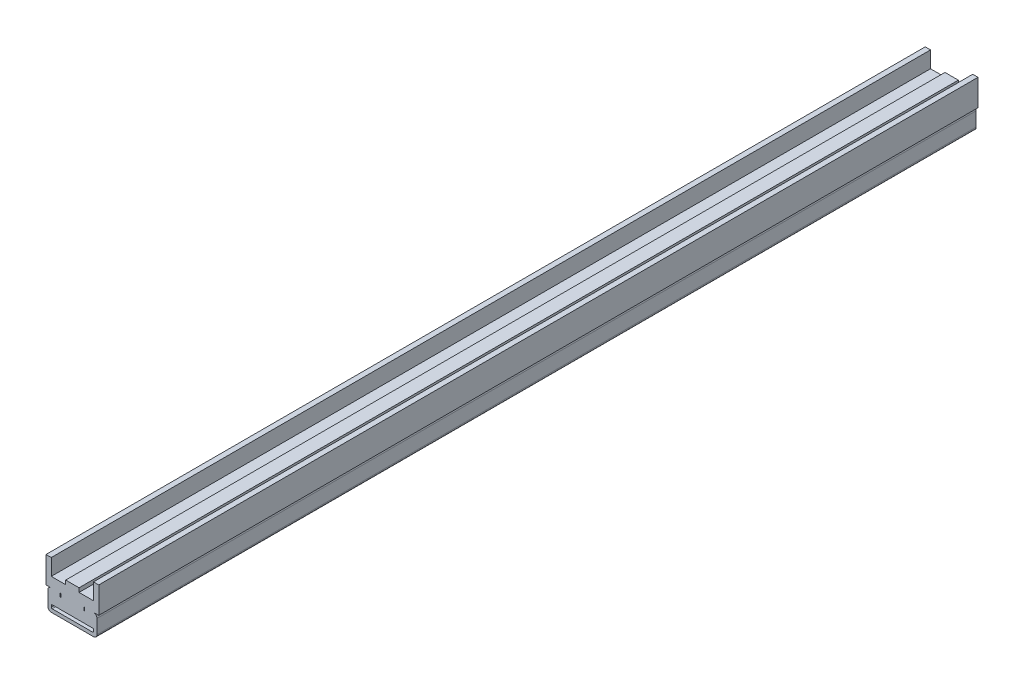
ISO-10303-21;
HEADER;
FILE_DESCRIPTION(('STEP AP214'),'2;1');
FILE_NAME('part.step','',(''),(''),'','','');
FILE_SCHEMA(('AUTOMOTIVE_DESIGN { 1 0 10303 214 1 1 1 1 }'));
ENDSEC;
DATA;
#1=APPLICATION_CONTEXT('core data for automotive mechanical design processes');
#2=APPLICATION_PROTOCOL_DEFINITION('international standard','automotive_design',2000,#1);
#3=PRODUCT_CONTEXT('',#1,'mechanical');
#4=PRODUCT('Part','Part','',(#3));
#5=PRODUCT_RELATED_PRODUCT_CATEGORY('part','',(#4));
#6=PRODUCT_DEFINITION_FORMATION('','',#4);
#7=PRODUCT_DEFINITION_CONTEXT('part definition',#1,'design');
#8=PRODUCT_DEFINITION('design','',#6,#7);
#9=PRODUCT_DEFINITION_SHAPE('','',#8);
#10=(LENGTH_UNIT() NAMED_UNIT(*) SI_UNIT(.MILLI.,.METRE.));
#11=(NAMED_UNIT(*) PLANE_ANGLE_UNIT() SI_UNIT($,.RADIAN.));
#12=(NAMED_UNIT(*) SI_UNIT($,.STERADIAN.) SOLID_ANGLE_UNIT());
#13=UNCERTAINTY_MEASURE_WITH_UNIT(LENGTH_MEASURE(1.E-05),#10,'distance_accuracy_value','');
#14=(GEOMETRIC_REPRESENTATION_CONTEXT(3) GLOBAL_UNCERTAINTY_ASSIGNED_CONTEXT((#13)) GLOBAL_UNIT_ASSIGNED_CONTEXT((#10,
#11,#12)) REPRESENTATION_CONTEXT('',''));
#15=CARTESIAN_POINT('',(0.,0.,0.));
#16=DIRECTION('',(0.,0.,1.));
#17=DIRECTION('',(1.,0.,0.));
#18=AXIS2_PLACEMENT_3D('',#15,#16,#17);
#19=CARTESIAN_POINT('',(-12.,10.,500.));
#20=DIRECTION('',(0.,0.,1.));
#21=DIRECTION('',(1.,0.,0.));
#22=AXIS2_PLACEMENT_3D('',#19,#20,#21);
#23=PLANE('',#22);
#24=DIRECTION('',(1.,0.,0.));
#25=VECTOR('',#24,1.);
#26=CARTESIAN_POINT('',(-7.,10.,500.));
#27=LINE('',#26,#25);
#28=CARTESIAN_POINT('',(-7.,10.,500.));
#29=VERTEX_POINT('',#28);
#30=CARTESIAN_POINT('',(-6.5,10.,500.));
#31=VERTEX_POINT('',#30);
#32=EDGE_CURVE('E273',#29,#31,#27,.T.);
#33=ORIENTED_EDGE('',*,*,#32,.F.);
#34=DIRECTION('',(0.,-1.,0.));
#35=VECTOR('',#34,1.);
#36=CARTESIAN_POINT('',(-7.,12.,500.));
#37=LINE('',#36,#35);
#38=CARTESIAN_POINT('',(-7.,12.,500.));
#39=VERTEX_POINT('',#38);
#40=EDGE_CURVE('E271',#39,#29,#37,.T.);
#41=ORIENTED_EDGE('',*,*,#40,.F.);
#42=DIRECTION('',(-1.,0.,0.));
#43=VECTOR('',#42,1.);
#44=CARTESIAN_POINT('',(-7.,12.,500.));
#45=LINE('',#44,#43);
#46=CARTESIAN_POINT('',(-6.5,12.,500.));
#47=VERTEX_POINT('',#46);
#48=EDGE_CURVE('E279',#47,#39,#45,.T.);
#49=ORIENTED_EDGE('',*,*,#48,.F.);
#50=DIRECTION('',(0.,1.,0.));
#51=VECTOR('',#50,1.);
#52=CARTESIAN_POINT('',(-6.5,12.,500.));
#53=LINE('',#52,#51);
#54=EDGE_CURVE('E276',#31,#47,#53,.T.);
#55=ORIENTED_EDGE('',*,*,#54,.F.);
#56=EDGE_LOOP('',(#33,#41,#49,#55));
#57=FACE_BOUND('',#56,.T.);
#58=CARTESIAN_POINT('',(-12.,10.,500.));
#59=DIRECTION('',(0.,0.,1.));
#60=DIRECTION('',(1.,0.,0.));
#61=AXIS2_PLACEMENT_3D('',#58,#59,#60);
#62=CIRCLE('',#61,2.);
#63=CARTESIAN_POINT('',(-12.,12.,500.));
#64=VERTEX_POINT('',#63);
#65=CARTESIAN_POINT('',(-14.,10.,500.));
#66=VERTEX_POINT('',#65);
#67=EDGE_CURVE('E347',#64,#66,#62,.T.);
#68=ORIENTED_EDGE('',*,*,#67,.T.);
#69=DIRECTION('',(0.,-1.,0.));
#70=VECTOR('',#69,1.);
#71=CARTESIAN_POINT('',(-14.,2.,500.));
#72=LINE('',#71,#70);
#73=CARTESIAN_POINT('',(-14.,2.,500.));
#74=VERTEX_POINT('',#73);
#75=EDGE_CURVE('E350',#66,#74,#72,.T.);
#76=ORIENTED_EDGE('',*,*,#75,.T.);
#77=CARTESIAN_POINT('',(-12.,2.,500.));
#78=DIRECTION('',(0.,0.,1.));
#79=DIRECTION('',(1.,0.,0.));
#80=AXIS2_PLACEMENT_3D('',#77,#78,#79);
#81=CIRCLE('',#80,2.);
#82=CARTESIAN_POINT('',(-12.,0.,500.));
#83=VERTEX_POINT('',#82);
#84=EDGE_CURVE('E353',#74,#83,#81,.T.);
#85=ORIENTED_EDGE('',*,*,#84,.T.);
#86=DIRECTION('',(1.,0.,0.));
#87=VECTOR('',#86,1.);
#88=CARTESIAN_POINT('',(-12.,0.,500.));
#89=LINE('',#88,#87);
#90=CARTESIAN_POINT('',(12.,0.,500.));
#91=VERTEX_POINT('',#90);
#92=EDGE_CURVE('E355',#83,#91,#89,.T.);
#93=ORIENTED_EDGE('',*,*,#92,.T.);
#94=CARTESIAN_POINT('',(12.,2.,500.));
#95=DIRECTION('',(0.,0.,1.));
#96=DIRECTION('',(1.,0.,0.));
#97=AXIS2_PLACEMENT_3D('',#94,#95,#96);
#98=CIRCLE('',#97,2.);
#99=CARTESIAN_POINT('',(14.,2.,500.));
#100=VERTEX_POINT('',#99);
#101=EDGE_CURVE('E357',#91,#100,#98,.T.);
#102=ORIENTED_EDGE('',*,*,#101,.T.);
#103=DIRECTION('',(0.,1.,0.));
#104=VECTOR('',#103,1.);
#105=CARTESIAN_POINT('',(14.,2.,500.));
#106=LINE('',#105,#104);
#107=CARTESIAN_POINT('',(14.,10.,500.));
#108=VERTEX_POINT('',#107);
#109=EDGE_CURVE('E359',#100,#108,#106,.T.);
#110=ORIENTED_EDGE('',*,*,#109,.T.);
#111=CARTESIAN_POINT('',(12.,10.,500.));
#112=DIRECTION('',(0.,0.,1.));
#113=DIRECTION('',(1.,0.,0.));
#114=AXIS2_PLACEMENT_3D('',#111,#112,#113);
#115=CIRCLE('',#114,2.);
#116=CARTESIAN_POINT('',(12.,12.,500.));
#117=VERTEX_POINT('',#116);
#118=EDGE_CURVE('E361',#108,#117,#115,.T.);
#119=ORIENTED_EDGE('',*,*,#118,.T.);
#120=DIRECTION('',(1.,0.,0.));
#121=VECTOR('',#120,1.);
#122=CARTESIAN_POINT('',(12.,12.,500.));
#123=LINE('',#122,#121);
#124=CARTESIAN_POINT('',(15.,12.,500.));
#125=VERTEX_POINT('',#124);
#126=EDGE_CURVE('E363',#117,#125,#123,.T.);
#127=ORIENTED_EDGE('',*,*,#126,.T.);
#128=DIRECTION('',(0.,1.,0.));
#129=VECTOR('',#128,1.);
#130=CARTESIAN_POINT('',(15.,12.,500.));
#131=LINE('',#130,#129);
#132=CARTESIAN_POINT('',(15.,27.,500.));
#133=VERTEX_POINT('',#132);
#134=EDGE_CURVE('E365',#125,#133,#131,.T.);
#135=ORIENTED_EDGE('',*,*,#134,.T.);
#136=DIRECTION('',(-1.,0.,0.));
#137=VECTOR('',#136,1.);
#138=CARTESIAN_POINT('',(15.,27.,500.));
#139=LINE('',#138,#137);
#140=CARTESIAN_POINT('',(12.,27.,500.));
#141=VERTEX_POINT('',#140);
#142=EDGE_CURVE('E367',#133,#141,#139,.T.);
#143=ORIENTED_EDGE('',*,*,#142,.T.);
#144=DIRECTION('',(0.,-1.,0.));
#145=VECTOR('',#144,1.);
#146=CARTESIAN_POINT('',(12.,27.,500.));
#147=LINE('',#146,#145);
#148=CARTESIAN_POINT('',(12.,17.7,500.));
#149=VERTEX_POINT('',#148);
#150=EDGE_CURVE('E369',#141,#149,#147,.T.);
#151=ORIENTED_EDGE('',*,*,#150,.T.);
#152=DIRECTION('',(-1.,0.,0.));
#153=VECTOR('',#152,1.);
#154=CARTESIAN_POINT('',(12.,17.7,500.));
#155=LINE('',#154,#153);
#156=CARTESIAN_POINT('',(3.8,17.7,500.));
#157=VERTEX_POINT('',#156);
#158=EDGE_CURVE('E371',#149,#157,#155,.T.);
#159=ORIENTED_EDGE('',*,*,#158,.T.);
#160=DIRECTION('',(0.,1.,0.));
#161=VECTOR('',#160,1.);
#162=CARTESIAN_POINT('',(3.8,17.7,500.));
#163=LINE('',#162,#161);
#164=CARTESIAN_POINT('',(3.8,20.,500.));
#165=VERTEX_POINT('',#164);
#166=EDGE_CURVE('E373',#157,#165,#163,.T.);
#167=ORIENTED_EDGE('',*,*,#166,.T.);
#168=DIRECTION('',(-1.,0.,0.));
#169=VECTOR('',#168,1.);
#170=CARTESIAN_POINT('',(3.8,20.,500.));
#171=LINE('',#170,#169);
#172=CARTESIAN_POINT('',(-3.8,20.,500.));
#173=VERTEX_POINT('',#172);
#174=EDGE_CURVE('E375',#165,#173,#171,.T.);
#175=ORIENTED_EDGE('',*,*,#174,.T.);
#176=DIRECTION('',(0.,-1.,0.));
#177=VECTOR('',#176,1.);
#178=CARTESIAN_POINT('',(-3.8,20.,500.));
#179=LINE('',#178,#177);
#180=CARTESIAN_POINT('',(-3.8,17.7,500.));
#181=VERTEX_POINT('',#180);
#182=EDGE_CURVE('E377',#173,#181,#179,.T.);
#183=ORIENTED_EDGE('',*,*,#182,.T.);
#184=DIRECTION('',(-1.,0.,0.));
#185=VECTOR('',#184,1.);
#186=CARTESIAN_POINT('',(-3.8,17.7,500.));
#187=LINE('',#186,#185);
#188=CARTESIAN_POINT('',(-12.,17.7,500.));
#189=VERTEX_POINT('',#188);
#190=EDGE_CURVE('E379',#181,#189,#187,.T.);
#191=ORIENTED_EDGE('',*,*,#190,.T.);
#192=DIRECTION('',(0.,1.,0.));
#193=VECTOR('',#192,1.);
#194=CARTESIAN_POINT('',(-12.,17.7,500.));
#195=LINE('',#194,#193);
#196=CARTESIAN_POINT('',(-12.,27.,500.));
#197=VERTEX_POINT('',#196);
#198=EDGE_CURVE('E381',#189,#197,#195,.T.);
#199=ORIENTED_EDGE('',*,*,#198,.T.);
#200=DIRECTION('',(-1.,0.,0.));
#201=VECTOR('',#200,1.);
#202=CARTESIAN_POINT('',(-12.,27.,500.));
#203=LINE('',#202,#201);
#204=CARTESIAN_POINT('',(-15.,27.,500.));
#205=VERTEX_POINT('',#204);
#206=EDGE_CURVE('E383',#197,#205,#203,.T.);
#207=ORIENTED_EDGE('',*,*,#206,.T.);
#208=DIRECTION('',(0.,-1.,0.));
#209=VECTOR('',#208,1.);
#210=CARTESIAN_POINT('',(-15.,27.,500.));
#211=LINE('',#210,#209);
#212=CARTESIAN_POINT('',(-15.,12.,500.));
#213=VERTEX_POINT('',#212);
#214=EDGE_CURVE('E385',#205,#213,#211,.T.);
#215=ORIENTED_EDGE('',*,*,#214,.T.);
#216=DIRECTION('',(1.,0.,0.));
#217=VECTOR('',#216,1.);
#218=CARTESIAN_POINT('',(-15.,12.,500.));
#219=LINE('',#218,#217);
#220=EDGE_CURVE('E387',#213,#64,#219,.T.);
#221=ORIENTED_EDGE('',*,*,#220,.T.);
#222=EDGE_LOOP('',(#68,#76,#85,#93,#102,#110,#119,#127,#135,#143,#151,#159,#167,#175,#183,#191,
#199,#207,#215,#221));
#223=FACE_BOUND('',#222,.T.);
#224=CARTESIAN_POINT('',(-11.5,2.5,500.));
#225=DIRECTION('',(0.,0.,1.));
#226=DIRECTION('',(1.,0.,0.));
#227=AXIS2_PLACEMENT_3D('',#224,#225,#226);
#228=CIRCLE('',#227,0.5);
#229=CARTESIAN_POINT('',(-12.,2.5,500.));
#230=VERTEX_POINT('',#229);
#231=CARTESIAN_POINT('',(-11.5,2.,500.));
#232=VERTEX_POINT('',#231);
#233=EDGE_CURVE('E304',#230,#232,#228,.T.);
#234=ORIENTED_EDGE('',*,*,#233,.F.);
#235=DIRECTION('',(0.,-1.,0.));
#236=VECTOR('',#235,1.);
#237=CARTESIAN_POINT('',(-12.,4.,500.));
#238=LINE('',#237,#236);
#239=CARTESIAN_POINT('',(-12.,4.,500.));
#240=VERTEX_POINT('',#239);
#241=EDGE_CURVE('E302',#240,#230,#238,.T.);
#242=ORIENTED_EDGE('',*,*,#241,.F.);
#243=DIRECTION('',(-1.,0.,0.));
#244=VECTOR('',#243,1.);
#245=CARTESIAN_POINT('',(-12.,4.,500.));
#246=LINE('',#245,#244);
#247=CARTESIAN_POINT('',(12.,4.,500.));
#248=VERTEX_POINT('',#247);
#249=EDGE_CURVE('E314',#248,#240,#246,.T.);
#250=ORIENTED_EDGE('',*,*,#249,.F.);
#251=DIRECTION('',(0.,1.,0.));
#252=VECTOR('',#251,1.);
#253=CARTESIAN_POINT('',(12.,4.,500.));
#254=LINE('',#253,#252);
#255=CARTESIAN_POINT('',(12.,2.5,500.));
#256=VERTEX_POINT('',#255);
#257=EDGE_CURVE('E311',#256,#248,#254,.T.);
#258=ORIENTED_EDGE('',*,*,#257,.F.);
#259=CARTESIAN_POINT('',(11.5,2.5,500.));
#260=DIRECTION('',(0.,0.,1.));
#261=DIRECTION('',(-1.,0.,0.));
#262=AXIS2_PLACEMENT_3D('',#259,#260,#261);
#263=CIRCLE('',#262,0.5);
#264=CARTESIAN_POINT('',(11.5,2.,500.));
#265=VERTEX_POINT('',#264);
#266=EDGE_CURVE('E309',#265,#256,#263,.T.);
#267=ORIENTED_EDGE('',*,*,#266,.F.);
#268=DIRECTION('',(1.,0.,0.));
#269=VECTOR('',#268,1.);
#270=CARTESIAN_POINT('',(-11.5,2.,500.));
#271=LINE('',#270,#269);
#272=EDGE_CURVE('E307',#232,#265,#271,.T.);
#273=ORIENTED_EDGE('',*,*,#272,.F.);
#274=EDGE_LOOP('',(#234,#242,#250,#258,#267,#273));
#275=FACE_BOUND('',#274,.T.);
#276=DIRECTION('',(-1.,0.,0.));
#277=VECTOR('',#276,1.);
#278=CARTESIAN_POINT('',(7.,12.,500.));
#279=LINE('',#278,#277);
#280=CARTESIAN_POINT('',(7.,12.,500.));
#281=VERTEX_POINT('',#280);
#282=CARTESIAN_POINT('',(6.5,12.,500.));
#283=VERTEX_POINT('',#282);
#284=EDGE_CURVE('E243',#281,#283,#279,.T.);
#285=ORIENTED_EDGE('',*,*,#284,.F.);
#286=DIRECTION('',(0.,1.,0.));
#287=VECTOR('',#286,1.);
#288=CARTESIAN_POINT('',(7.,12.,500.));
#289=LINE('',#288,#287);
#290=CARTESIAN_POINT('',(7.,10.,500.));
#291=VERTEX_POINT('',#290);
#292=EDGE_CURVE('E235',#291,#281,#289,.T.);
#293=ORIENTED_EDGE('',*,*,#292,.F.);
#294=DIRECTION('',(1.,0.,0.));
#295=VECTOR('',#294,1.);
#296=CARTESIAN_POINT('',(7.,10.,500.));
#297=LINE('',#296,#295);
#298=CARTESIAN_POINT('',(6.5,10.,500.));
#299=VERTEX_POINT('',#298);
#300=EDGE_CURVE('E257',#299,#291,#297,.T.);
#301=ORIENTED_EDGE('',*,*,#300,.F.);
#302=DIRECTION('',(0.,-1.,0.));
#303=VECTOR('',#302,1.);
#304=CARTESIAN_POINT('',(6.5,12.,500.));
#305=LINE('',#304,#303);
#306=EDGE_CURVE('E255',#283,#299,#305,.T.);
#307=ORIENTED_EDGE('',*,*,#306,.F.);
#308=EDGE_LOOP('',(#285,#293,#301,#307));
#309=FACE_BOUND('',#308,.T.);
#310=ADVANCED_FACE('F14',(#57,#223,#275,#309),#23,.T.);
#311=CARTESIAN_POINT('',(-12.,10.,0.));
#312=DIRECTION('',(0.,0.,1.));
#313=DIRECTION('',(1.,0.,0.));
#314=AXIS2_PLACEMENT_3D('',#311,#312,#313);
#315=PLANE('',#314);
#316=DIRECTION('',(0.,-1.,0.));
#317=VECTOR('',#316,1.);
#318=CARTESIAN_POINT('',(-7.,12.,0.));
#319=LINE('',#318,#317);
#320=CARTESIAN_POINT('',(-7.,12.,0.));
#321=VERTEX_POINT('',#320);
#322=CARTESIAN_POINT('',(-7.,10.,0.));
#323=VERTEX_POINT('',#322);
#324=EDGE_CURVE('E251',#321,#323,#319,.T.);
#325=ORIENTED_EDGE('',*,*,#324,.T.);
#326=DIRECTION('',(1.,0.,0.));
#327=VECTOR('',#326,1.);
#328=CARTESIAN_POINT('',(-7.,10.,0.));
#329=LINE('',#328,#327);
#330=CARTESIAN_POINT('',(-6.5,10.,0.));
#331=VERTEX_POINT('',#330);
#332=EDGE_CURVE('E284',#323,#331,#329,.T.);
#333=ORIENTED_EDGE('',*,*,#332,.T.);
#334=DIRECTION('',(0.,1.,0.));
#335=VECTOR('',#334,1.);
#336=CARTESIAN_POINT('',(-6.5,12.,0.));
#337=LINE('',#336,#335);
#338=CARTESIAN_POINT('',(-6.5,12.,0.));
#339=VERTEX_POINT('',#338);
#340=EDGE_CURVE('E287',#331,#339,#337,.T.);
#341=ORIENTED_EDGE('',*,*,#340,.T.);
#342=DIRECTION('',(-1.,0.,0.));
#343=VECTOR('',#342,1.);
#344=CARTESIAN_POINT('',(-7.,12.,0.));
#345=LINE('',#344,#343);
#346=EDGE_CURVE('E274',#339,#321,#345,.T.);
#347=ORIENTED_EDGE('',*,*,#346,.T.);
#348=EDGE_LOOP('',(#325,#333,#341,#347));
#349=FACE_BOUND('',#348,.T.);
#350=CARTESIAN_POINT('',(-12.,10.,0.));
#351=DIRECTION('',(0.,0.,1.));
#352=DIRECTION('',(1.,0.,0.));
#353=AXIS2_PLACEMENT_3D('',#350,#351,#352);
#354=CIRCLE('',#353,2.);
#355=CARTESIAN_POINT('',(-12.,12.,0.));
#356=VERTEX_POINT('',#355);
#357=CARTESIAN_POINT('',(-14.,10.,0.));
#358=VERTEX_POINT('',#357);
#359=EDGE_CURVE('E346',#356,#358,#354,.T.);
#360=ORIENTED_EDGE('',*,*,#359,.F.);
#361=DIRECTION('',(1.,0.,0.));
#362=VECTOR('',#361,1.);
#363=CARTESIAN_POINT('',(-15.,12.,0.));
#364=LINE('',#363,#362);
#365=CARTESIAN_POINT('',(-15.,12.,0.));
#366=VERTEX_POINT('',#365);
#367=EDGE_CURVE('E351',#366,#356,#364,.T.);
#368=ORIENTED_EDGE('',*,*,#367,.F.);
#369=DIRECTION('',(0.,-1.,0.));
#370=VECTOR('',#369,1.);
#371=CARTESIAN_POINT('',(-15.,27.,0.));
#372=LINE('',#371,#370);
#373=CARTESIAN_POINT('',(-15.,27.,0.));
#374=VERTEX_POINT('',#373);
#375=EDGE_CURVE('E426',#374,#366,#372,.T.);
#376=ORIENTED_EDGE('',*,*,#375,.F.);
#377=DIRECTION('',(-1.,0.,0.));
#378=VECTOR('',#377,1.);
#379=CARTESIAN_POINT('',(-12.,27.,0.));
#380=LINE('',#379,#378);
#381=CARTESIAN_POINT('',(-12.,27.,0.));
#382=VERTEX_POINT('',#381);
#383=EDGE_CURVE('E424',#382,#374,#380,.T.);
#384=ORIENTED_EDGE('',*,*,#383,.F.);
#385=DIRECTION('',(0.,1.,0.));
#386=VECTOR('',#385,1.);
#387=CARTESIAN_POINT('',(-12.,17.7,0.));
#388=LINE('',#387,#386);
#389=CARTESIAN_POINT('',(-12.,17.7,0.));
#390=VERTEX_POINT('',#389);
#391=EDGE_CURVE('E422',#390,#382,#388,.T.);
#392=ORIENTED_EDGE('',*,*,#391,.F.);
#393=DIRECTION('',(-1.,0.,0.));
#394=VECTOR('',#393,1.);
#395=CARTESIAN_POINT('',(-3.8,17.7,0.));
#396=LINE('',#395,#394);
#397=CARTESIAN_POINT('',(-3.8,17.7,0.));
#398=VERTEX_POINT('',#397);
#399=EDGE_CURVE('E420',#398,#390,#396,.T.);
#400=ORIENTED_EDGE('',*,*,#399,.F.);
#401=DIRECTION('',(0.,-1.,0.));
#402=VECTOR('',#401,1.);
#403=CARTESIAN_POINT('',(-3.8,20.,0.));
#404=LINE('',#403,#402);
#405=CARTESIAN_POINT('',(-3.8,20.,0.));
#406=VERTEX_POINT('',#405);
#407=EDGE_CURVE('E418',#406,#398,#404,.T.);
#408=ORIENTED_EDGE('',*,*,#407,.F.);
#409=DIRECTION('',(-1.,0.,0.));
#410=VECTOR('',#409,1.);
#411=CARTESIAN_POINT('',(3.8,20.,0.));
#412=LINE('',#411,#410);
#413=CARTESIAN_POINT('',(3.8,20.,0.));
#414=VERTEX_POINT('',#413);
#415=EDGE_CURVE('E416',#414,#406,#412,.T.);
#416=ORIENTED_EDGE('',*,*,#415,.F.);
#417=DIRECTION('',(0.,1.,0.));
#418=VECTOR('',#417,1.);
#419=CARTESIAN_POINT('',(3.8,17.7,0.));
#420=LINE('',#419,#418);
#421=CARTESIAN_POINT('',(3.8,17.7,0.));
#422=VERTEX_POINT('',#421);
#423=EDGE_CURVE('E414',#422,#414,#420,.T.);
#424=ORIENTED_EDGE('',*,*,#423,.F.);
#425=DIRECTION('',(-1.,0.,0.));
#426=VECTOR('',#425,1.);
#427=CARTESIAN_POINT('',(12.,17.7,0.));
#428=LINE('',#427,#426);
#429=CARTESIAN_POINT('',(12.,17.7,0.));
#430=VERTEX_POINT('',#429);
#431=EDGE_CURVE('E412',#430,#422,#428,.T.);
#432=ORIENTED_EDGE('',*,*,#431,.F.);
#433=DIRECTION('',(0.,-1.,0.));
#434=VECTOR('',#433,1.);
#435=CARTESIAN_POINT('',(12.,27.,0.));
#436=LINE('',#435,#434);
#437=CARTESIAN_POINT('',(12.,27.,0.));
#438=VERTEX_POINT('',#437);
#439=EDGE_CURVE('E410',#438,#430,#436,.T.);
#440=ORIENTED_EDGE('',*,*,#439,.F.);
#441=DIRECTION('',(-1.,0.,0.));
#442=VECTOR('',#441,1.);
#443=CARTESIAN_POINT('',(15.,27.,0.));
#444=LINE('',#443,#442);
#445=CARTESIAN_POINT('',(15.,27.,0.));
#446=VERTEX_POINT('',#445);
#447=EDGE_CURVE('E408',#446,#438,#444,.T.);
#448=ORIENTED_EDGE('',*,*,#447,.F.);
#449=DIRECTION('',(0.,1.,0.));
#450=VECTOR('',#449,1.);
#451=CARTESIAN_POINT('',(15.,12.,0.));
#452=LINE('',#451,#450);
#453=CARTESIAN_POINT('',(15.,12.,0.));
#454=VERTEX_POINT('',#453);
#455=EDGE_CURVE('E406',#454,#446,#452,.T.);
#456=ORIENTED_EDGE('',*,*,#455,.F.);
#457=DIRECTION('',(1.,0.,0.));
#458=VECTOR('',#457,1.);
#459=CARTESIAN_POINT('',(12.,12.,0.));
#460=LINE('',#459,#458);
#461=CARTESIAN_POINT('',(12.,12.,0.));
#462=VERTEX_POINT('',#461);
#463=EDGE_CURVE('E404',#462,#454,#460,.T.);
#464=ORIENTED_EDGE('',*,*,#463,.F.);
#465=CARTESIAN_POINT('',(12.,10.,0.));
#466=DIRECTION('',(0.,0.,1.));
#467=DIRECTION('',(1.,0.,0.));
#468=AXIS2_PLACEMENT_3D('',#465,#466,#467);
#469=CIRCLE('',#468,2.);
#470=CARTESIAN_POINT('',(14.,10.,0.));
#471=VERTEX_POINT('',#470);
#472=EDGE_CURVE('E402',#471,#462,#469,.T.);
#473=ORIENTED_EDGE('',*,*,#472,.F.);
#474=DIRECTION('',(0.,1.,0.));
#475=VECTOR('',#474,1.);
#476=CARTESIAN_POINT('',(14.,2.,0.));
#477=LINE('',#476,#475);
#478=CARTESIAN_POINT('',(14.,2.,0.));
#479=VERTEX_POINT('',#478);
#480=EDGE_CURVE('E400',#479,#471,#477,.T.);
#481=ORIENTED_EDGE('',*,*,#480,.F.);
#482=CARTESIAN_POINT('',(12.,2.,0.));
#483=DIRECTION('',(0.,0.,1.));
#484=DIRECTION('',(1.,0.,0.));
#485=AXIS2_PLACEMENT_3D('',#482,#483,#484);
#486=CIRCLE('',#485,2.);
#487=CARTESIAN_POINT('',(12.,0.,0.));
#488=VERTEX_POINT('',#487);
#489=EDGE_CURVE('E398',#488,#479,#486,.T.);
#490=ORIENTED_EDGE('',*,*,#489,.F.);
#491=DIRECTION('',(1.,0.,0.));
#492=VECTOR('',#491,1.);
#493=CARTESIAN_POINT('',(-12.,0.,0.));
#494=LINE('',#493,#492);
#495=CARTESIAN_POINT('',(-12.,0.,0.));
#496=VERTEX_POINT('',#495);
#497=EDGE_CURVE('E396',#496,#488,#494,.T.);
#498=ORIENTED_EDGE('',*,*,#497,.F.);
#499=CARTESIAN_POINT('',(-12.,2.,0.));
#500=DIRECTION('',(0.,0.,1.));
#501=DIRECTION('',(1.,0.,0.));
#502=AXIS2_PLACEMENT_3D('',#499,#500,#501);
#503=CIRCLE('',#502,2.);
#504=CARTESIAN_POINT('',(-14.,2.,0.));
#505=VERTEX_POINT('',#504);
#506=EDGE_CURVE('E394',#505,#496,#503,.T.);
#507=ORIENTED_EDGE('',*,*,#506,.F.);
#508=DIRECTION('',(0.,-1.,0.));
#509=VECTOR('',#508,1.);
#510=CARTESIAN_POINT('',(-14.,2.,0.));
#511=LINE('',#510,#509);
#512=EDGE_CURVE('E392',#358,#505,#511,.T.);
#513=ORIENTED_EDGE('',*,*,#512,.F.);
#514=EDGE_LOOP('',(#360,#368,#376,#384,#392,#400,#408,#416,#424,#432,#440,#448,#456,#464,#473,
#481,#490,#498,#507,#513));
#515=FACE_BOUND('',#514,.T.);
#516=DIRECTION('',(0.,-1.,0.));
#517=VECTOR('',#516,1.);
#518=CARTESIAN_POINT('',(-12.,4.,0.));
#519=LINE('',#518,#517);
#520=CARTESIAN_POINT('',(-12.,4.,0.));
#521=VERTEX_POINT('',#520);
#522=CARTESIAN_POINT('',(-12.,2.5,0.));
#523=VERTEX_POINT('',#522);
#524=EDGE_CURVE('E301',#521,#523,#519,.T.);
#525=ORIENTED_EDGE('',*,*,#524,.T.);
#526=CARTESIAN_POINT('',(-11.5,2.5,0.));
#527=DIRECTION('',(0.,0.,1.));
#528=DIRECTION('',(1.,0.,0.));
#529=AXIS2_PLACEMENT_3D('',#526,#527,#528);
#530=CIRCLE('',#529,0.5);
#531=CARTESIAN_POINT('',(-11.5,2.,0.));
#532=VERTEX_POINT('',#531);
#533=EDGE_CURVE('E319',#523,#532,#530,.T.);
#534=ORIENTED_EDGE('',*,*,#533,.T.);
#535=DIRECTION('',(1.,0.,0.));
#536=VECTOR('',#535,1.);
#537=CARTESIAN_POINT('',(-11.5,2.,0.));
#538=LINE('',#537,#536);
#539=CARTESIAN_POINT('',(11.5,2.,0.));
#540=VERTEX_POINT('',#539);
#541=EDGE_CURVE('E322',#532,#540,#538,.T.);
#542=ORIENTED_EDGE('',*,*,#541,.T.);
#543=CARTESIAN_POINT('',(11.5,2.5,0.));
#544=DIRECTION('',(0.,0.,1.));
#545=DIRECTION('',(-1.,0.,0.));
#546=AXIS2_PLACEMENT_3D('',#543,#544,#545);
#547=CIRCLE('',#546,0.5);
#548=CARTESIAN_POINT('',(12.,2.5,0.));
#549=VERTEX_POINT('',#548);
#550=EDGE_CURVE('E325',#540,#549,#547,.T.);
#551=ORIENTED_EDGE('',*,*,#550,.T.);
#552=DIRECTION('',(0.,1.,0.));
#553=VECTOR('',#552,1.);
#554=CARTESIAN_POINT('',(12.,4.,0.));
#555=LINE('',#554,#553);
#556=CARTESIAN_POINT('',(12.,4.,0.));
#557=VERTEX_POINT('',#556);
#558=EDGE_CURVE('E328',#549,#557,#555,.T.);
#559=ORIENTED_EDGE('',*,*,#558,.T.);
#560=DIRECTION('',(-1.,0.,0.));
#561=VECTOR('',#560,1.);
#562=CARTESIAN_POINT('',(-12.,4.,0.));
#563=LINE('',#562,#561);
#564=EDGE_CURVE('E305',#557,#521,#563,.T.);
#565=ORIENTED_EDGE('',*,*,#564,.T.);
#566=EDGE_LOOP('',(#525,#534,#542,#551,#559,#565));
#567=FACE_BOUND('',#566,.T.);
#568=DIRECTION('',(0.,1.,0.));
#569=VECTOR('',#568,1.);
#570=CARTESIAN_POINT('',(7.,12.,0.));
#571=LINE('',#570,#569);
#572=CARTESIAN_POINT('',(7.,10.,0.));
#573=VERTEX_POINT('',#572);
#574=CARTESIAN_POINT('',(7.,12.,0.));
#575=VERTEX_POINT('',#574);
#576=EDGE_CURVE('E37',#573,#575,#571,.T.);
#577=ORIENTED_EDGE('',*,*,#576,.T.);
#578=DIRECTION('',(-1.,0.,0.));
#579=VECTOR('',#578,1.);
#580=CARTESIAN_POINT('',(7.,12.,0.));
#581=LINE('',#580,#579);
#582=CARTESIAN_POINT('',(6.5,12.,0.));
#583=VERTEX_POINT('',#582);
#584=EDGE_CURVE('E250',#575,#583,#581,.T.);
#585=ORIENTED_EDGE('',*,*,#584,.T.);
#586=DIRECTION('',(0.,-1.,0.));
#587=VECTOR('',#586,1.);
#588=CARTESIAN_POINT('',(6.5,12.,0.));
#589=LINE('',#588,#587);
#590=CARTESIAN_POINT('',(6.5,10.,0.));
#591=VERTEX_POINT('',#590);
#592=EDGE_CURVE('E263',#583,#591,#589,.T.);
#593=ORIENTED_EDGE('',*,*,#592,.T.);
#594=DIRECTION('',(1.,0.,0.));
#595=VECTOR('',#594,1.);
#596=CARTESIAN_POINT('',(7.,10.,0.));
#597=LINE('',#596,#595);
#598=EDGE_CURVE('E244',#591,#573,#597,.T.);
#599=ORIENTED_EDGE('',*,*,#598,.T.);
#600=EDGE_LOOP('',(#577,#585,#593,#599));
#601=FACE_BOUND('',#600,.T.);
#602=ADVANCED_FACE('F492',(#349,#515,#567,#601),#315,.F.);
#603=CARTESIAN_POINT('',(-12.,10.,500.));
#604=DIRECTION('',(0.,0.,-1.));
#605=DIRECTION('',(-1.,0.,0.));
#606=AXIS2_PLACEMENT_3D('',#603,#604,#605);
#607=CYLINDRICAL_SURFACE('',#606,2.);
#608=ORIENTED_EDGE('',*,*,#359,.T.);
#609=DIRECTION('',(0.,0.,-1.));
#610=VECTOR('',#609,1.);
#611=CARTESIAN_POINT('',(-14.,10.,500.));
#612=LINE('',#611,#610);
#613=EDGE_CURVE('E9',#66,#358,#612,.T.);
#614=ORIENTED_EDGE('',*,*,#613,.F.);
#615=ORIENTED_EDGE('',*,*,#67,.F.);
#616=DIRECTION('',(0.,0.,-1.));
#617=VECTOR('',#616,1.);
#618=CARTESIAN_POINT('',(-12.,12.,500.));
#619=LINE('',#618,#617);
#620=EDGE_CURVE('E389',#64,#356,#619,.T.);
#621=ORIENTED_EDGE('',*,*,#620,.T.);
#622=EDGE_LOOP('',(#608,#614,#615,#621));
#623=FACE_BOUND('',#622,.T.);
#624=ADVANCED_FACE('F16',(#623),#607,.T.);
#625=CARTESIAN_POINT('',(-14.,2.,500.));
#626=DIRECTION('',(1.,0.,0.));
#627=DIRECTION('',(0.,0.,-1.));
#628=AXIS2_PLACEMENT_3D('',#625,#626,#627);
#629=PLANE('',#628);
#630=ORIENTED_EDGE('',*,*,#512,.T.);
#631=DIRECTION('',(0.,0.,-1.));
#632=VECTOR('',#631,1.);
#633=CARTESIAN_POINT('',(-14.,2.,500.));
#634=LINE('',#633,#632);
#635=EDGE_CURVE('E22',#74,#505,#634,.T.);
#636=ORIENTED_EDGE('',*,*,#635,.F.);
#637=ORIENTED_EDGE('',*,*,#75,.F.);
#638=ORIENTED_EDGE('',*,*,#613,.T.);
#639=EDGE_LOOP('',(#630,#636,#637,#638));
#640=FACE_BOUND('',#639,.T.);
#641=ADVANCED_FACE('F510',(#640),#629,.F.);
#642=CARTESIAN_POINT('',(-12.,2.,500.));
#643=DIRECTION('',(0.,0.,-1.));
#644=DIRECTION('',(-1.,0.,0.));
#645=AXIS2_PLACEMENT_3D('',#642,#643,#644);
#646=CYLINDRICAL_SURFACE('',#645,2.);
#647=ORIENTED_EDGE('',*,*,#506,.T.);
#648=DIRECTION('',(0.,0.,-1.));
#649=VECTOR('',#648,1.);
#650=CARTESIAN_POINT('',(-12.,0.,500.));
#651=LINE('',#650,#649);
#652=EDGE_CURVE('E479',#83,#496,#651,.T.);
#653=ORIENTED_EDGE('',*,*,#652,.F.);
#654=ORIENTED_EDGE('',*,*,#84,.F.);
#655=ORIENTED_EDGE('',*,*,#635,.T.);
#656=EDGE_LOOP('',(#647,#653,#654,#655));
#657=FACE_BOUND('',#656,.T.);
#658=ADVANCED_FACE('F486',(#657),#646,.T.);
#659=CARTESIAN_POINT('',(-12.,0.,500.));
#660=DIRECTION('',(0.,1.,0.));
#661=DIRECTION('',(0.,0.,1.));
#662=AXIS2_PLACEMENT_3D('',#659,#660,#661);
#663=PLANE('',#662);
#664=ORIENTED_EDGE('',*,*,#497,.T.);
#665=DIRECTION('',(0.,0.,-1.));
#666=VECTOR('',#665,1.);
#667=CARTESIAN_POINT('',(12.,0.,500.));
#668=LINE('',#667,#666);
#669=EDGE_CURVE('E476',#91,#488,#668,.T.);
#670=ORIENTED_EDGE('',*,*,#669,.F.);
#671=ORIENTED_EDGE('',*,*,#92,.F.);
#672=ORIENTED_EDGE('',*,*,#652,.T.);
#673=EDGE_LOOP('',(#664,#670,#671,#672));
#674=FACE_BOUND('',#673,.T.);
#675=ADVANCED_FACE('F498',(#674),#663,.F.);
#676=CARTESIAN_POINT('',(12.,2.,500.));
#677=DIRECTION('',(0.,0.,-1.));
#678=DIRECTION('',(-1.,0.,0.));
#679=AXIS2_PLACEMENT_3D('',#676,#677,#678);
#680=CYLINDRICAL_SURFACE('',#679,2.);
#681=ORIENTED_EDGE('',*,*,#489,.T.);
#682=DIRECTION('',(0.,0.,-1.));
#683=VECTOR('',#682,1.);
#684=CARTESIAN_POINT('',(14.,2.,500.));
#685=LINE('',#684,#683);
#686=EDGE_CURVE('E473',#100,#479,#685,.T.);
#687=ORIENTED_EDGE('',*,*,#686,.F.);
#688=ORIENTED_EDGE('',*,*,#101,.F.);
#689=ORIENTED_EDGE('',*,*,#669,.T.);
#690=EDGE_LOOP('',(#681,#687,#688,#689));
#691=FACE_BOUND('',#690,.T.);
#692=ADVANCED_FACE('F502',(#691),#680,.T.);
#693=CARTESIAN_POINT('',(14.,2.,500.));
#694=DIRECTION('',(-1.,0.,0.));
#695=DIRECTION('',(0.,0.,1.));
#696=AXIS2_PLACEMENT_3D('',#693,#694,#695);
#697=PLANE('',#696);
#698=ORIENTED_EDGE('',*,*,#480,.T.);
#699=DIRECTION('',(0.,0.,-1.));
#700=VECTOR('',#699,1.);
#701=CARTESIAN_POINT('',(14.,10.,500.));
#702=LINE('',#701,#700);
#703=EDGE_CURVE('E470',#108,#471,#702,.T.);
#704=ORIENTED_EDGE('',*,*,#703,.F.);
#705=ORIENTED_EDGE('',*,*,#109,.F.);
#706=ORIENTED_EDGE('',*,*,#686,.T.);
#707=EDGE_LOOP('',(#698,#704,#705,#706));
#708=FACE_BOUND('',#707,.T.);
#709=ADVANCED_FACE('F583',(#708),#697,.F.);
#710=CARTESIAN_POINT('',(12.,10.,500.));
#711=DIRECTION('',(0.,0.,-1.));
#712=DIRECTION('',(-1.,0.,0.));
#713=AXIS2_PLACEMENT_3D('',#710,#711,#712);
#714=CYLINDRICAL_SURFACE('',#713,2.);
#715=ORIENTED_EDGE('',*,*,#472,.T.);
#716=DIRECTION('',(0.,0.,-1.));
#717=VECTOR('',#716,1.);
#718=CARTESIAN_POINT('',(12.,12.,500.));
#719=LINE('',#718,#717);
#720=EDGE_CURVE('E467',#117,#462,#719,.T.);
#721=ORIENTED_EDGE('',*,*,#720,.F.);
#722=ORIENTED_EDGE('',*,*,#118,.F.);
#723=ORIENTED_EDGE('',*,*,#703,.T.);
#724=EDGE_LOOP('',(#715,#721,#722,#723));
#725=FACE_BOUND('',#724,.T.);
#726=ADVANCED_FACE('F581',(#725),#714,.T.);
#727=CARTESIAN_POINT('',(12.,12.,500.));
#728=DIRECTION('',(0.,1.,0.));
#729=DIRECTION('',(0.,0.,1.));
#730=AXIS2_PLACEMENT_3D('',#727,#728,#729);
#731=PLANE('',#730);
#732=ORIENTED_EDGE('',*,*,#463,.T.);
#733=DIRECTION('',(0.,0.,-1.));
#734=VECTOR('',#733,1.);
#735=CARTESIAN_POINT('',(15.,12.,500.));
#736=LINE('',#735,#734);
#737=EDGE_CURVE('E464',#125,#454,#736,.T.);
#738=ORIENTED_EDGE('',*,*,#737,.F.);
#739=ORIENTED_EDGE('',*,*,#126,.F.);
#740=ORIENTED_EDGE('',*,*,#720,.T.);
#741=EDGE_LOOP('',(#732,#738,#739,#740));
#742=FACE_BOUND('',#741,.T.);
#743=ADVANCED_FACE('F576',(#742),#731,.F.);
#744=CARTESIAN_POINT('',(15.,12.,500.));
#745=DIRECTION('',(-1.,0.,0.));
#746=DIRECTION('',(0.,0.,1.));
#747=AXIS2_PLACEMENT_3D('',#744,#745,#746);
#748=PLANE('',#747);
#749=ORIENTED_EDGE('',*,*,#455,.T.);
#750=DIRECTION('',(0.,0.,-1.));
#751=VECTOR('',#750,1.);
#752=CARTESIAN_POINT('',(15.,27.,500.));
#753=LINE('',#752,#751);
#754=EDGE_CURVE('E461',#133,#446,#753,.T.);
#755=ORIENTED_EDGE('',*,*,#754,.F.);
#756=ORIENTED_EDGE('',*,*,#134,.F.);
#757=ORIENTED_EDGE('',*,*,#737,.T.);
#758=EDGE_LOOP('',(#749,#755,#756,#757));
#759=FACE_BOUND('',#758,.T.);
#760=ADVANCED_FACE('F571',(#759),#748,.F.);
#761=CARTESIAN_POINT('',(15.,27.,500.));
#762=DIRECTION('',(0.,-1.,0.));
#763=DIRECTION('',(0.,0.,-1.));
#764=AXIS2_PLACEMENT_3D('',#761,#762,#763);
#765=PLANE('',#764);
#766=ORIENTED_EDGE('',*,*,#447,.T.);
#767=DIRECTION('',(0.,0.,-1.));
#768=VECTOR('',#767,1.);
#769=CARTESIAN_POINT('',(12.,27.,500.));
#770=LINE('',#769,#768);
#771=EDGE_CURVE('E458',#141,#438,#770,.T.);
#772=ORIENTED_EDGE('',*,*,#771,.F.);
#773=ORIENTED_EDGE('',*,*,#142,.F.);
#774=ORIENTED_EDGE('',*,*,#754,.T.);
#775=EDGE_LOOP('',(#766,#772,#773,#774));
#776=FACE_BOUND('',#775,.T.);
#777=ADVANCED_FACE('F567',(#776),#765,.F.);
#778=CARTESIAN_POINT('',(12.,27.,500.));
#779=DIRECTION('',(1.,0.,0.));
#780=DIRECTION('',(0.,1.,0.));
#781=AXIS2_PLACEMENT_3D('',#778,#779,#780);
#782=PLANE('',#781);
#783=ORIENTED_EDGE('',*,*,#439,.T.);
#784=DIRECTION('',(0.,0.,-1.));
#785=VECTOR('',#784,1.);
#786=CARTESIAN_POINT('',(12.,17.7,500.));
#787=LINE('',#786,#785);
#788=EDGE_CURVE('E455',#149,#430,#787,.T.);
#789=ORIENTED_EDGE('',*,*,#788,.F.);
#790=ORIENTED_EDGE('',*,*,#150,.F.);
#791=ORIENTED_EDGE('',*,*,#771,.T.);
#792=EDGE_LOOP('',(#783,#789,#790,#791));
#793=FACE_BOUND('',#792,.T.);
#794=ADVANCED_FACE('F562',(#793),#782,.F.);
#795=CARTESIAN_POINT('',(12.,17.7,500.));
#796=DIRECTION('',(0.,-1.,0.));
#797=DIRECTION('',(0.,0.,-1.));
#798=AXIS2_PLACEMENT_3D('',#795,#796,#797);
#799=PLANE('',#798);
#800=ORIENTED_EDGE('',*,*,#431,.T.);
#801=DIRECTION('',(0.,0.,-1.));
#802=VECTOR('',#801,1.);
#803=CARTESIAN_POINT('',(3.8,17.7,500.));
#804=LINE('',#803,#802);
#805=EDGE_CURVE('E452',#157,#422,#804,.T.);
#806=ORIENTED_EDGE('',*,*,#805,.F.);
#807=ORIENTED_EDGE('',*,*,#158,.F.);
#808=ORIENTED_EDGE('',*,*,#788,.T.);
#809=EDGE_LOOP('',(#800,#806,#807,#808));
#810=FACE_BOUND('',#809,.T.);
#811=ADVANCED_FACE('F556',(#810),#799,.F.);
#812=CARTESIAN_POINT('',(3.8,17.7,500.));
#813=DIRECTION('',(-1.,0.,0.));
#814=DIRECTION('',(0.,-1.,0.));
#815=AXIS2_PLACEMENT_3D('',#812,#813,#814);
#816=PLANE('',#815);
#817=ORIENTED_EDGE('',*,*,#423,.T.);
#818=DIRECTION('',(0.,0.,-1.));
#819=VECTOR('',#818,1.);
#820=CARTESIAN_POINT('',(3.8,20.,500.));
#821=LINE('',#820,#819);
#822=EDGE_CURVE('E449',#165,#414,#821,.T.);
#823=ORIENTED_EDGE('',*,*,#822,.F.);
#824=ORIENTED_EDGE('',*,*,#166,.F.);
#825=ORIENTED_EDGE('',*,*,#805,.T.);
#826=EDGE_LOOP('',(#817,#823,#824,#825));
#827=FACE_BOUND('',#826,.T.);
#828=ADVANCED_FACE('F552',(#827),#816,.F.);
#829=CARTESIAN_POINT('',(3.8,20.,500.));
#830=DIRECTION('',(0.,-1.,0.));
#831=DIRECTION('',(0.,0.,-1.));
#832=AXIS2_PLACEMENT_3D('',#829,#830,#831);
#833=PLANE('',#832);
#834=ORIENTED_EDGE('',*,*,#415,.T.);
#835=DIRECTION('',(0.,0.,-1.));
#836=VECTOR('',#835,1.);
#837=CARTESIAN_POINT('',(-3.8,20.,500.));
#838=LINE('',#837,#836);
#839=EDGE_CURVE('E446',#173,#406,#838,.T.);
#840=ORIENTED_EDGE('',*,*,#839,.F.);
#841=ORIENTED_EDGE('',*,*,#174,.F.);
#842=ORIENTED_EDGE('',*,*,#822,.T.);
#843=EDGE_LOOP('',(#834,#840,#841,#842));
#844=FACE_BOUND('',#843,.T.);
#845=ADVANCED_FACE('F547',(#844),#833,.F.);
#846=CARTESIAN_POINT('',(-3.8,20.,500.));
#847=DIRECTION('',(1.,0.,0.));
#848=DIRECTION('',(0.,0.,-1.));
#849=AXIS2_PLACEMENT_3D('',#846,#847,#848);
#850=PLANE('',#849);
#851=ORIENTED_EDGE('',*,*,#407,.T.);
#852=DIRECTION('',(0.,0.,-1.));
#853=VECTOR('',#852,1.);
#854=CARTESIAN_POINT('',(-3.8,17.7,500.));
#855=LINE('',#854,#853);
#856=EDGE_CURVE('E443',#181,#398,#855,.T.);
#857=ORIENTED_EDGE('',*,*,#856,.F.);
#858=ORIENTED_EDGE('',*,*,#182,.F.);
#859=ORIENTED_EDGE('',*,*,#839,.T.);
#860=EDGE_LOOP('',(#851,#857,#858,#859));
#861=FACE_BOUND('',#860,.T.);
#862=ADVANCED_FACE('F541',(#861),#850,.F.);
#863=CARTESIAN_POINT('',(-3.8,17.7,500.));
#864=DIRECTION('',(0.,-1.,0.));
#865=DIRECTION('',(0.,0.,-1.));
#866=AXIS2_PLACEMENT_3D('',#863,#864,#865);
#867=PLANE('',#866);
#868=ORIENTED_EDGE('',*,*,#399,.T.);
#869=DIRECTION('',(0.,0.,-1.));
#870=VECTOR('',#869,1.);
#871=CARTESIAN_POINT('',(-12.,17.7,500.));
#872=LINE('',#871,#870);
#873=EDGE_CURVE('E440',#189,#390,#872,.T.);
#874=ORIENTED_EDGE('',*,*,#873,.F.);
#875=ORIENTED_EDGE('',*,*,#190,.F.);
#876=ORIENTED_EDGE('',*,*,#856,.T.);
#877=EDGE_LOOP('',(#868,#874,#875,#876));
#878=FACE_BOUND('',#877,.T.);
#879=ADVANCED_FACE('F537',(#878),#867,.F.);
#880=CARTESIAN_POINT('',(-12.,17.7,500.));
#881=DIRECTION('',(-1.,0.,0.));
#882=DIRECTION('',(0.,0.,1.));
#883=AXIS2_PLACEMENT_3D('',#880,#881,#882);
#884=PLANE('',#883);
#885=ORIENTED_EDGE('',*,*,#391,.T.);
#886=DIRECTION('',(0.,0.,-1.));
#887=VECTOR('',#886,1.);
#888=CARTESIAN_POINT('',(-12.,27.,500.));
#889=LINE('',#888,#887);
#890=EDGE_CURVE('E437',#197,#382,#889,.T.);
#891=ORIENTED_EDGE('',*,*,#890,.F.);
#892=ORIENTED_EDGE('',*,*,#198,.F.);
#893=ORIENTED_EDGE('',*,*,#873,.T.);
#894=EDGE_LOOP('',(#885,#891,#892,#893));
#895=FACE_BOUND('',#894,.T.);
#896=ADVANCED_FACE('F532',(#895),#884,.F.);
#897=CARTESIAN_POINT('',(-12.,27.,500.));
#898=DIRECTION('',(0.,-1.,0.));
#899=DIRECTION('',(1.,0.,0.));
#900=AXIS2_PLACEMENT_3D('',#897,#898,#899);
#901=PLANE('',#900);
#902=ORIENTED_EDGE('',*,*,#383,.T.);
#903=DIRECTION('',(0.,0.,-1.));
#904=VECTOR('',#903,1.);
#905=CARTESIAN_POINT('',(-15.,27.,500.));
#906=LINE('',#905,#904);
#907=EDGE_CURVE('E434',#205,#374,#906,.T.);
#908=ORIENTED_EDGE('',*,*,#907,.F.);
#909=ORIENTED_EDGE('',*,*,#206,.F.);
#910=ORIENTED_EDGE('',*,*,#890,.T.);
#911=EDGE_LOOP('',(#902,#908,#909,#910));
#912=FACE_BOUND('',#911,.T.);
#913=ADVANCED_FACE('F526',(#912),#901,.F.);
#914=CARTESIAN_POINT('',(-15.,27.,500.));
#915=DIRECTION('',(1.,0.,0.));
#916=DIRECTION('',(0.,1.,0.));
#917=AXIS2_PLACEMENT_3D('',#914,#915,#916);
#918=PLANE('',#917);
#919=ORIENTED_EDGE('',*,*,#375,.T.);
#920=DIRECTION('',(0.,0.,-1.));
#921=VECTOR('',#920,1.);
#922=CARTESIAN_POINT('',(-15.,12.,500.));
#923=LINE('',#922,#921);
#924=EDGE_CURVE('E431',#213,#366,#923,.T.);
#925=ORIENTED_EDGE('',*,*,#924,.F.);
#926=ORIENTED_EDGE('',*,*,#214,.F.);
#927=ORIENTED_EDGE('',*,*,#907,.T.);
#928=EDGE_LOOP('',(#919,#925,#926,#927));
#929=FACE_BOUND('',#928,.T.);
#930=ADVANCED_FACE('F522',(#929),#918,.F.);
#931=CARTESIAN_POINT('',(-15.,12.,500.));
#932=DIRECTION('',(0.,1.,0.));
#933=DIRECTION('',(0.,0.,1.));
#934=AXIS2_PLACEMENT_3D('',#931,#932,#933);
#935=PLANE('',#934);
#936=ORIENTED_EDGE('',*,*,#367,.T.);
#937=ORIENTED_EDGE('',*,*,#620,.F.);
#938=ORIENTED_EDGE('',*,*,#220,.F.);
#939=ORIENTED_EDGE('',*,*,#924,.T.);
#940=EDGE_LOOP('',(#936,#937,#938,#939));
#941=FACE_BOUND('',#940,.T.);
#942=ADVANCED_FACE('F517',(#941),#935,.F.);
#943=CARTESIAN_POINT('',(-12.,4.,500.));
#944=DIRECTION('',(1.,0.,0.));
#945=DIRECTION('',(0.,1.,0.));
#946=AXIS2_PLACEMENT_3D('',#943,#944,#945);
#947=PLANE('',#946);
#948=ORIENTED_EDGE('',*,*,#524,.F.);
#949=DIRECTION('',(0.,0.,-1.));
#950=VECTOR('',#949,1.);
#951=CARTESIAN_POINT('',(-12.,4.,500.));
#952=LINE('',#951,#950);
#953=EDGE_CURVE('E316',#240,#521,#952,.T.);
#954=ORIENTED_EDGE('',*,*,#953,.F.);
#955=ORIENTED_EDGE('',*,*,#241,.T.);
#956=DIRECTION('',(0.,0.,-1.));
#957=VECTOR('',#956,1.);
#958=CARTESIAN_POINT('',(-12.,2.5,500.));
#959=LINE('',#958,#957);
#960=EDGE_CURVE('E343',#230,#523,#959,.T.);
#961=ORIENTED_EDGE('',*,*,#960,.T.);
#962=EDGE_LOOP('',(#948,#954,#955,#961));
#963=FACE_BOUND('',#962,.T.);
#964=ADVANCED_FACE('F605',(#963),#947,.T.);
#965=CARTESIAN_POINT('',(-11.5,2.5,500.));
#966=DIRECTION('',(0.,0.,-1.));
#967=DIRECTION('',(-1.,0.,0.));
#968=AXIS2_PLACEMENT_3D('',#965,#966,#967);
#969=CYLINDRICAL_SURFACE('',#968,0.5);
#970=ORIENTED_EDGE('',*,*,#533,.F.);
#971=ORIENTED_EDGE('',*,*,#960,.F.);
#972=ORIENTED_EDGE('',*,*,#233,.T.);
#973=DIRECTION('',(0.,0.,-1.));
#974=VECTOR('',#973,1.);
#975=CARTESIAN_POINT('',(-11.5,2.,500.));
#976=LINE('',#975,#974);
#977=EDGE_CURVE('E341',#232,#532,#976,.T.);
#978=ORIENTED_EDGE('',*,*,#977,.T.);
#979=EDGE_LOOP('',(#970,#971,#972,#978));
#980=FACE_BOUND('',#979,.T.);
#981=ADVANCED_FACE('F710',(#980),#969,.F.);
#982=CARTESIAN_POINT('',(-11.5,2.,500.));
#983=DIRECTION('',(0.,1.,0.));
#984=DIRECTION('',(0.,0.,1.));
#985=AXIS2_PLACEMENT_3D('',#982,#983,#984);
#986=PLANE('',#985);
#987=ORIENTED_EDGE('',*,*,#541,.F.);
#988=ORIENTED_EDGE('',*,*,#977,.F.);
#989=ORIENTED_EDGE('',*,*,#272,.T.);
#990=DIRECTION('',(0.,0.,-1.));
#991=VECTOR('',#990,1.);
#992=CARTESIAN_POINT('',(11.5,2.,500.));
#993=LINE('',#992,#991);
#994=EDGE_CURVE('E339',#265,#540,#993,.T.);
#995=ORIENTED_EDGE('',*,*,#994,.T.);
#996=EDGE_LOOP('',(#987,#988,#989,#995));
#997=FACE_BOUND('',#996,.T.);
#998=ADVANCED_FACE('F718',(#997),#986,.T.);
#999=CARTESIAN_POINT('',(11.5,2.5,500.));
#1000=DIRECTION('',(0.,0.,-1.));
#1001=DIRECTION('',(-1.,0.,0.));
#1002=AXIS2_PLACEMENT_3D('',#999,#1000,#1001);
#1003=CYLINDRICAL_SURFACE('',#1002,0.5);
#1004=ORIENTED_EDGE('',*,*,#550,.F.);
#1005=ORIENTED_EDGE('',*,*,#994,.F.);
#1006=ORIENTED_EDGE('',*,*,#266,.T.);
#1007=DIRECTION('',(0.,0.,-1.));
#1008=VECTOR('',#1007,1.);
#1009=CARTESIAN_POINT('',(12.,2.5,500.));
#1010=LINE('',#1009,#1008);
#1011=EDGE_CURVE('E337',#256,#549,#1010,.T.);
#1012=ORIENTED_EDGE('',*,*,#1011,.T.);
#1013=EDGE_LOOP('',(#1004,#1005,#1006,#1012));
#1014=FACE_BOUND('',#1013,.T.);
#1015=ADVANCED_FACE('F726',(#1014),#1003,.F.);
#1016=CARTESIAN_POINT('',(12.,4.,500.));
#1017=DIRECTION('',(-1.,0.,0.));
#1018=DIRECTION('',(0.,-1.,0.));
#1019=AXIS2_PLACEMENT_3D('',#1016,#1017,#1018);
#1020=PLANE('',#1019);
#1021=ORIENTED_EDGE('',*,*,#558,.F.);
#1022=ORIENTED_EDGE('',*,*,#1011,.F.);
#1023=ORIENTED_EDGE('',*,*,#257,.T.);
#1024=DIRECTION('',(0.,0.,-1.));
#1025=VECTOR('',#1024,1.);
#1026=CARTESIAN_POINT('',(12.,4.,500.));
#1027=LINE('',#1026,#1025);
#1028=EDGE_CURVE('E335',#248,#557,#1027,.T.);
#1029=ORIENTED_EDGE('',*,*,#1028,.T.);
#1030=EDGE_LOOP('',(#1021,#1022,#1023,#1029));
#1031=FACE_BOUND('',#1030,.T.);
#1032=ADVANCED_FACE('F735',(#1031),#1020,.T.);
#1033=CARTESIAN_POINT('',(-12.,4.,500.));
#1034=DIRECTION('',(0.,-1.,0.));
#1035=DIRECTION('',(1.,0.,0.));
#1036=AXIS2_PLACEMENT_3D('',#1033,#1034,#1035);
#1037=PLANE('',#1036);
#1038=ORIENTED_EDGE('',*,*,#564,.F.);
#1039=ORIENTED_EDGE('',*,*,#1028,.F.);
#1040=ORIENTED_EDGE('',*,*,#249,.T.);
#1041=ORIENTED_EDGE('',*,*,#953,.T.);
#1042=EDGE_LOOP('',(#1038,#1039,#1040,#1041));
#1043=FACE_BOUND('',#1042,.T.);
#1044=ADVANCED_FACE('F744',(#1043),#1037,.T.);
#1045=CARTESIAN_POINT('',(-7.,12.,500.));
#1046=DIRECTION('',(1.,0.,0.));
#1047=DIRECTION('',(0.,0.,-1.));
#1048=AXIS2_PLACEMENT_3D('',#1045,#1046,#1047);
#1049=PLANE('',#1048);
#1050=ORIENTED_EDGE('',*,*,#324,.F.);
#1051=DIRECTION('',(0.,0.,-1.));
#1052=VECTOR('',#1051,1.);
#1053=CARTESIAN_POINT('',(-7.,12.,500.));
#1054=LINE('',#1053,#1052);
#1055=EDGE_CURVE('E281',#39,#321,#1054,.T.);
#1056=ORIENTED_EDGE('',*,*,#1055,.F.);
#1057=ORIENTED_EDGE('',*,*,#40,.T.);
#1058=DIRECTION('',(0.,0.,-1.));
#1059=VECTOR('',#1058,1.);
#1060=CARTESIAN_POINT('',(-7.,10.,500.));
#1061=LINE('',#1060,#1059);
#1062=EDGE_CURVE('E298',#29,#323,#1061,.T.);
#1063=ORIENTED_EDGE('',*,*,#1062,.T.);
#1064=EDGE_LOOP('',(#1050,#1056,#1057,#1063));
#1065=FACE_BOUND('',#1064,.T.);
#1066=ADVANCED_FACE('F753',(#1065),#1049,.T.);
#1067=CARTESIAN_POINT('',(-7.,10.,500.));
#1068=DIRECTION('',(0.,1.,0.));
#1069=DIRECTION('',(0.,0.,1.));
#1070=AXIS2_PLACEMENT_3D('',#1067,#1068,#1069);
#1071=PLANE('',#1070);
#1072=ORIENTED_EDGE('',*,*,#332,.F.);
#1073=ORIENTED_EDGE('',*,*,#1062,.F.);
#1074=ORIENTED_EDGE('',*,*,#32,.T.);
#1075=DIRECTION('',(0.,0.,-1.));
#1076=VECTOR('',#1075,1.);
#1077=CARTESIAN_POINT('',(-6.5,10.,500.));
#1078=LINE('',#1077,#1076);
#1079=EDGE_CURVE('E296',#31,#331,#1078,.T.);
#1080=ORIENTED_EDGE('',*,*,#1079,.T.);
#1081=EDGE_LOOP('',(#1072,#1073,#1074,#1080));
#1082=FACE_BOUND('',#1081,.T.);
#1083=ADVANCED_FACE('F762',(#1082),#1071,.T.);
#1084=CARTESIAN_POINT('',(-6.5,12.,500.));
#1085=DIRECTION('',(-1.,0.,0.));
#1086=DIRECTION('',(0.,0.,1.));
#1087=AXIS2_PLACEMENT_3D('',#1084,#1085,#1086);
#1088=PLANE('',#1087);
#1089=ORIENTED_EDGE('',*,*,#340,.F.);
#1090=ORIENTED_EDGE('',*,*,#1079,.F.);
#1091=ORIENTED_EDGE('',*,*,#54,.T.);
#1092=DIRECTION('',(0.,0.,-1.));
#1093=VECTOR('',#1092,1.);
#1094=CARTESIAN_POINT('',(-6.5,12.,500.));
#1095=LINE('',#1094,#1093);
#1096=EDGE_CURVE('E294',#47,#339,#1095,.T.);
#1097=ORIENTED_EDGE('',*,*,#1096,.T.);
#1098=EDGE_LOOP('',(#1089,#1090,#1091,#1097));
#1099=FACE_BOUND('',#1098,.T.);
#1100=ADVANCED_FACE('F771',(#1099),#1088,.T.);
#1101=CARTESIAN_POINT('',(-7.,12.,500.));
#1102=DIRECTION('',(0.,-1.,0.));
#1103=DIRECTION('',(0.,0.,-1.));
#1104=AXIS2_PLACEMENT_3D('',#1101,#1102,#1103);
#1105=PLANE('',#1104);
#1106=ORIENTED_EDGE('',*,*,#346,.F.);
#1107=ORIENTED_EDGE('',*,*,#1096,.F.);
#1108=ORIENTED_EDGE('',*,*,#48,.T.);
#1109=ORIENTED_EDGE('',*,*,#1055,.T.);
#1110=EDGE_LOOP('',(#1106,#1107,#1108,#1109));
#1111=FACE_BOUND('',#1110,.T.);
#1112=ADVANCED_FACE('F780',(#1111),#1105,.T.);
#1113=CARTESIAN_POINT('',(7.,12.,500.));
#1114=DIRECTION('',(-1.,0.,0.));
#1115=DIRECTION('',(0.,0.,1.));
#1116=AXIS2_PLACEMENT_3D('',#1113,#1114,#1115);
#1117=PLANE('',#1116);
#1118=ORIENTED_EDGE('',*,*,#576,.F.);
#1119=DIRECTION('',(0.,0.,-1.));
#1120=VECTOR('',#1119,1.);
#1121=CARTESIAN_POINT('',(7.,10.,500.));
#1122=LINE('',#1121,#1120);
#1123=EDGE_CURVE('E239',#291,#573,#1122,.T.);
#1124=ORIENTED_EDGE('',*,*,#1123,.F.);
#1125=ORIENTED_EDGE('',*,*,#292,.T.);
#1126=DIRECTION('',(0.,0.,-1.));
#1127=VECTOR('',#1126,1.);
#1128=CARTESIAN_POINT('',(7.,12.,500.));
#1129=LINE('',#1128,#1127);
#1130=EDGE_CURVE('E238',#281,#575,#1129,.T.);
#1131=ORIENTED_EDGE('',*,*,#1130,.T.);
#1132=EDGE_LOOP('',(#1118,#1124,#1125,#1131));
#1133=FACE_BOUND('',#1132,.T.);
#1134=ADVANCED_FACE('F237',(#1133),#1117,.T.);
#1135=CARTESIAN_POINT('',(7.,12.,500.));
#1136=DIRECTION('',(0.,-1.,0.));
#1137=DIRECTION('',(1.,0.,0.));
#1138=AXIS2_PLACEMENT_3D('',#1135,#1136,#1137);
#1139=PLANE('',#1138);
#1140=ORIENTED_EDGE('',*,*,#584,.F.);
#1141=ORIENTED_EDGE('',*,*,#1130,.F.);
#1142=ORIENTED_EDGE('',*,*,#284,.T.);
#1143=DIRECTION('',(0.,0.,-1.));
#1144=VECTOR('',#1143,1.);
#1145=CARTESIAN_POINT('',(6.5,12.,500.));
#1146=LINE('',#1145,#1144);
#1147=EDGE_CURVE('E252',#283,#583,#1146,.T.);
#1148=ORIENTED_EDGE('',*,*,#1147,.T.);
#1149=EDGE_LOOP('',(#1140,#1141,#1142,#1148));
#1150=FACE_BOUND('',#1149,.T.);
#1151=ADVANCED_FACE('F247',(#1150),#1139,.T.);
#1152=CARTESIAN_POINT('',(6.5,12.,500.));
#1153=DIRECTION('',(1.,0.,0.));
#1154=DIRECTION('',(0.,0.,-1.));
#1155=AXIS2_PLACEMENT_3D('',#1152,#1153,#1154);
#1156=PLANE('',#1155);
#1157=ORIENTED_EDGE('',*,*,#592,.F.);
#1158=ORIENTED_EDGE('',*,*,#1147,.F.);
#1159=ORIENTED_EDGE('',*,*,#306,.T.);
#1160=DIRECTION('',(0.,0.,-1.));
#1161=VECTOR('',#1160,1.);
#1162=CARTESIAN_POINT('',(6.5,10.,500.));
#1163=LINE('',#1162,#1161);
#1164=EDGE_CURVE('E29',#299,#591,#1163,.T.);
#1165=ORIENTED_EDGE('',*,*,#1164,.T.);
#1166=EDGE_LOOP('',(#1157,#1158,#1159,#1165));
#1167=FACE_BOUND('',#1166,.T.);
#1168=ADVANCED_FACE('F804',(#1167),#1156,.T.);
#1169=CARTESIAN_POINT('',(7.,10.,500.));
#1170=DIRECTION('',(0.,1.,0.));
#1171=DIRECTION('',(0.,0.,1.));
#1172=AXIS2_PLACEMENT_3D('',#1169,#1170,#1171);
#1173=PLANE('',#1172);
#1174=ORIENTED_EDGE('',*,*,#598,.F.);
#1175=ORIENTED_EDGE('',*,*,#1164,.F.);
#1176=ORIENTED_EDGE('',*,*,#300,.T.);
#1177=ORIENTED_EDGE('',*,*,#1123,.T.);
#1178=EDGE_LOOP('',(#1174,#1175,#1176,#1177));
#1179=FACE_BOUND('',#1178,.T.);
#1180=ADVANCED_FACE('F812',(#1179),#1173,.T.);
#1181=CLOSED_SHELL('',(#310,#602,#624,#641,#658,#675,#692,#709,#726,#743,#760,#777,#794,#811,
#828,#845,#862,#879,#896,#913,#930,#942,#964,#981,#998,#1015,#1032,#1044,#1066,#1083,#1100,
#1112,#1134,#1151,#1168,#1180));
#1182=MANIFOLD_SOLID_BREP('B1',#1181);
#1183=ADVANCED_BREP_SHAPE_REPRESENTATION('',(#18,#1182),#14);
#1184=SHAPE_DEFINITION_REPRESENTATION(#9,#1183);
ENDSEC;
END-ISO-10303-21;
